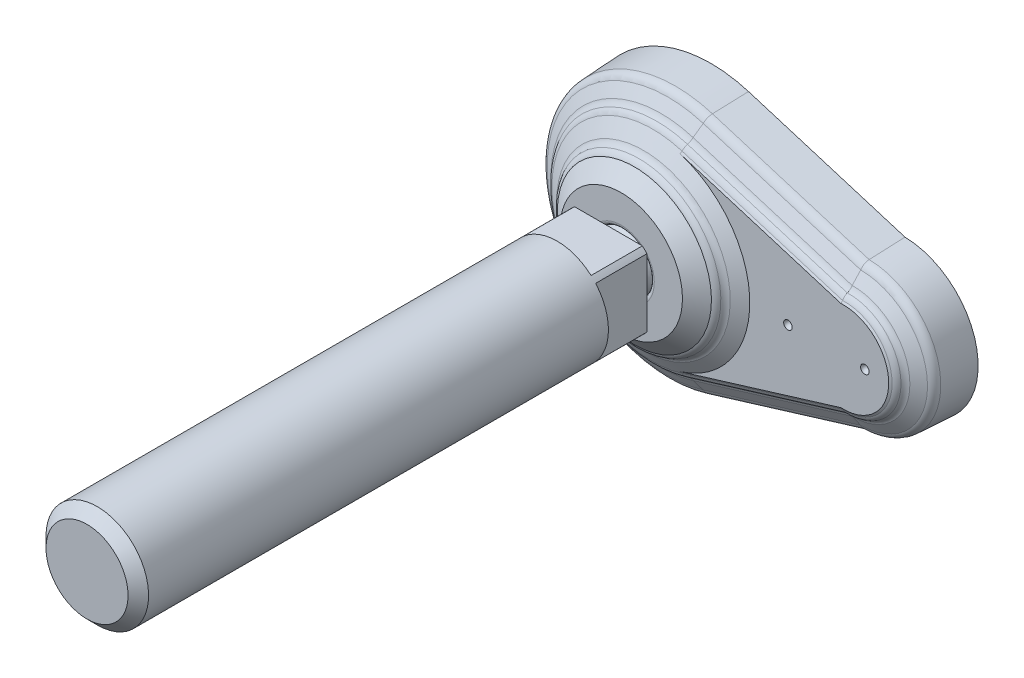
ISO-10303-21;
HEADER;
FILE_DESCRIPTION(('STEP AP214'),'2;1');
FILE_NAME('part.step','',(''),(''),'','','');
FILE_SCHEMA(('AUTOMOTIVE_DESIGN { 1 0 10303 214 1 1 1 1 }'));
ENDSEC;
DATA;
#1=APPLICATION_CONTEXT('core data for automotive mechanical design processes');
#2=APPLICATION_PROTOCOL_DEFINITION('international standard','automotive_design',2000,#1);
#3=PRODUCT_CONTEXT('',#1,'mechanical');
#4=PRODUCT('Part','Part','',(#3));
#5=PRODUCT_RELATED_PRODUCT_CATEGORY('part','',(#4));
#6=PRODUCT_DEFINITION_FORMATION('','',#4);
#7=PRODUCT_DEFINITION_CONTEXT('part definition',#1,'design');
#8=PRODUCT_DEFINITION('design','',#6,#7);
#9=PRODUCT_DEFINITION_SHAPE('','',#8);
#10=(LENGTH_UNIT() NAMED_UNIT(*) SI_UNIT(.MILLI.,.METRE.));
#11=(NAMED_UNIT(*) PLANE_ANGLE_UNIT() SI_UNIT($,.RADIAN.));
#12=(NAMED_UNIT(*) SI_UNIT($,.STERADIAN.) SOLID_ANGLE_UNIT());
#13=UNCERTAINTY_MEASURE_WITH_UNIT(LENGTH_MEASURE(1.E-05),#10,'distance_accuracy_value','');
#14=(GEOMETRIC_REPRESENTATION_CONTEXT(3) GLOBAL_UNCERTAINTY_ASSIGNED_CONTEXT((#13)) GLOBAL_UNIT_ASSIGNED_CONTEXT((#10,
#11,#12)) REPRESENTATION_CONTEXT('',''));
#15=CARTESIAN_POINT('',(0.,0.,0.));
#16=DIRECTION('',(0.,0.,1.));
#17=DIRECTION('',(1.,0.,0.));
#18=AXIS2_PLACEMENT_3D('',#15,#16,#17);
#19=CARTESIAN_POINT('',(0.,0.,36.));
#20=DIRECTION('',(0.,0.,1.));
#21=DIRECTION('',(-1.,0.,0.));
#22=AXIS2_PLACEMENT_3D('',#19,#20,#21);
#23=CYLINDRICAL_SURFACE('',#22,12.);
#24=CARTESIAN_POINT('',(0.,0.,143.6));
#25=DIRECTION('',(0.,0.,1.));
#26=DIRECTION('',(-1.,0.,0.));
#27=AXIS2_PLACEMENT_3D('',#24,#25,#26);
#28=CIRCLE('',#27,12.);
#29=CARTESIAN_POINT('',(-12.,0.,143.6));
#30=VERTEX_POINT('',#29);
#31=EDGE_CURVE('E9',#30,#30,#28,.F.);
#32=ORIENTED_EDGE('',*,*,#31,.T.);
#33=EDGE_LOOP('',(#32));
#34=FACE_BOUND('',#33,.T.);
#35=DIRECTION('',(0.,0.,1.));
#36=VECTOR('',#35,1.);
#37=CARTESIAN_POINT('',(-7.93725393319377,-9.,36.));
#38=LINE('',#37,#36);
#39=CARTESIAN_POINT('',(-7.93725393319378,-9.,36.));
#40=VERTEX_POINT('',#39);
#41=CARTESIAN_POINT('',(-7.93725393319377,-9.,24.));
#42=VERTEX_POINT('',#41);
#43=EDGE_CURVE('E136',#40,#42,#38,.F.);
#44=ORIENTED_EDGE('',*,*,#43,.F.);
#45=CARTESIAN_POINT('',(0.,0.,36.));
#46=DIRECTION('',(0.,0.,1.));
#47=DIRECTION('',(0.,-1.,0.));
#48=AXIS2_PLACEMENT_3D('',#45,#46,#47);
#49=CIRCLE('',#48,12.);
#50=CARTESIAN_POINT('',(7.93725393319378,-9.,36.));
#51=VERTEX_POINT('',#50);
#52=EDGE_CURVE('E598',#40,#51,#49,.T.);
#53=ORIENTED_EDGE('',*,*,#52,.T.);
#54=DIRECTION('',(0.,0.,1.));
#55=VECTOR('',#54,1.);
#56=CARTESIAN_POINT('',(7.93725393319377,-9.,36.));
#57=LINE('',#56,#55);
#58=CARTESIAN_POINT('',(7.93725393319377,-9.,24.));
#59=VERTEX_POINT('',#58);
#60=EDGE_CURVE('E201',#59,#51,#57,.T.);
#61=ORIENTED_EDGE('',*,*,#60,.F.);
#62=CARTESIAN_POINT('',(0.,0.,24.));
#63=DIRECTION('',(0.,0.,1.));
#64=DIRECTION('',(-1.,0.,0.));
#65=AXIS2_PLACEMENT_3D('',#62,#63,#64);
#66=CIRCLE('',#65,12.);
#67=CARTESIAN_POINT('',(9.,-7.93725393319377,24.));
#68=VERTEX_POINT('',#67);
#69=EDGE_CURVE('E184',#59,#68,#66,.T.);
#70=ORIENTED_EDGE('',*,*,#69,.T.);
#71=DIRECTION('',(0.,0.,1.));
#72=VECTOR('',#71,1.);
#73=CARTESIAN_POINT('',(9.,-7.93725393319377,36.));
#74=LINE('',#73,#72);
#75=CARTESIAN_POINT('',(9.,-7.93725393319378,36.));
#76=VERTEX_POINT('',#75);
#77=EDGE_CURVE('E198',#76,#68,#74,.F.);
#78=ORIENTED_EDGE('',*,*,#77,.F.);
#79=CARTESIAN_POINT('',(9.,7.93725393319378,36.));
#80=VERTEX_POINT('',#79);
#81=EDGE_CURVE('E266',#76,#80,#49,.T.);
#82=ORIENTED_EDGE('',*,*,#81,.T.);
#83=DIRECTION('',(0.,0.,1.));
#84=VECTOR('',#83,1.);
#85=CARTESIAN_POINT('',(9.,7.93725393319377,36.));
#86=LINE('',#85,#84);
#87=CARTESIAN_POINT('',(9.,7.93725393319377,24.));
#88=VERTEX_POINT('',#87);
#89=EDGE_CURVE('E243',#88,#80,#86,.T.);
#90=ORIENTED_EDGE('',*,*,#89,.F.);
#91=CARTESIAN_POINT('',(7.93725393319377,9.,24.));
#92=VERTEX_POINT('',#91);
#93=EDGE_CURVE('E180',#88,#92,#66,.T.);
#94=ORIENTED_EDGE('',*,*,#93,.T.);
#95=DIRECTION('',(0.,0.,1.));
#96=VECTOR('',#95,1.);
#97=CARTESIAN_POINT('',(7.93725393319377,9.,36.));
#98=LINE('',#97,#96);
#99=CARTESIAN_POINT('',(7.93725393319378,9.,36.));
#100=VERTEX_POINT('',#99);
#101=EDGE_CURVE('E161',#100,#92,#98,.F.);
#102=ORIENTED_EDGE('',*,*,#101,.F.);
#103=CARTESIAN_POINT('',(-7.93725393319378,9.,36.));
#104=VERTEX_POINT('',#103);
#105=EDGE_CURVE('E174',#100,#104,#49,.T.);
#106=ORIENTED_EDGE('',*,*,#105,.T.);
#107=DIRECTION('',(0.,0.,1.));
#108=VECTOR('',#107,1.);
#109=CARTESIAN_POINT('',(-7.93725393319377,9.,36.));
#110=LINE('',#109,#108);
#111=CARTESIAN_POINT('',(-7.93725393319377,9.,24.));
#112=VERTEX_POINT('',#111);
#113=EDGE_CURVE('E159',#112,#104,#110,.T.);
#114=ORIENTED_EDGE('',*,*,#113,.F.);
#115=CARTESIAN_POINT('',(-9.,7.93725393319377,24.));
#116=VERTEX_POINT('',#115);
#117=EDGE_CURVE('E172',#112,#116,#66,.T.);
#118=ORIENTED_EDGE('',*,*,#117,.T.);
#119=DIRECTION('',(0.,0.,1.));
#120=VECTOR('',#119,1.);
#121=CARTESIAN_POINT('',(-9.,7.93725393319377,36.));
#122=LINE('',#121,#120);
#123=CARTESIAN_POINT('',(-9.,7.93725393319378,36.));
#124=VERTEX_POINT('',#123);
#125=EDGE_CURVE('E175',#124,#116,#122,.F.);
#126=ORIENTED_EDGE('',*,*,#125,.F.);
#127=CARTESIAN_POINT('',(-9.,-7.93725393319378,36.));
#128=VERTEX_POINT('',#127);
#129=EDGE_CURVE('E599',#124,#128,#49,.T.);
#130=ORIENTED_EDGE('',*,*,#129,.T.);
#131=DIRECTION('',(0.,0.,1.));
#132=VECTOR('',#131,1.);
#133=CARTESIAN_POINT('',(-9.,-7.93725393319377,36.));
#134=LINE('',#133,#132);
#135=CARTESIAN_POINT('',(-9.,-7.93725393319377,24.));
#136=VERTEX_POINT('',#135);
#137=EDGE_CURVE('E181',#136,#128,#134,.T.);
#138=ORIENTED_EDGE('',*,*,#137,.F.);
#139=EDGE_CURVE('E183',#136,#42,#66,.T.);
#140=ORIENTED_EDGE('',*,*,#139,.T.);
#141=EDGE_LOOP('',(#44,#53,#61,#70,#78,#82,#90,#94,#102,#106,#114,#118,#126,#130,#138,#140));
#142=FACE_BOUND('',#141,.T.);
#143=ADVANCED_FACE('F14',(#34,#142),#23,.T.);
#144=CARTESIAN_POINT('',(-5.24903501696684,0.,24.));
#145=DIRECTION('',(0.,0.,1.));
#146=DIRECTION('',(-1.,0.,0.));
#147=AXIS2_PLACEMENT_3D('',#144,#145,#146);
#148=PLANE('',#147);
#149=DIRECTION('',(0.,-1.,0.));
#150=VECTOR('',#149,1.);
#151=CARTESIAN_POINT('',(-9.,9.,24.));
#152=LINE('',#151,#150);
#153=EDGE_CURVE('E31',#116,#136,#152,.T.);
#154=ORIENTED_EDGE('',*,*,#153,.F.);
#155=ORIENTED_EDGE('',*,*,#117,.F.);
#156=DIRECTION('',(-1.,0.,0.));
#157=VECTOR('',#156,1.);
#158=CARTESIAN_POINT('',(9.,9.,24.));
#159=LINE('',#158,#157);
#160=EDGE_CURVE('E154',#92,#112,#159,.T.);
#161=ORIENTED_EDGE('',*,*,#160,.F.);
#162=ORIENTED_EDGE('',*,*,#93,.F.);
#163=DIRECTION('',(0.,1.,0.));
#164=VECTOR('',#163,1.);
#165=CARTESIAN_POINT('',(9.,-9.,24.));
#166=LINE('',#165,#164);
#167=EDGE_CURVE('E166',#68,#88,#166,.T.);
#168=ORIENTED_EDGE('',*,*,#167,.F.);
#169=ORIENTED_EDGE('',*,*,#69,.F.);
#170=DIRECTION('',(1.,0.,0.));
#171=VECTOR('',#170,1.);
#172=CARTESIAN_POINT('',(-9.,-9.,24.));
#173=LINE('',#172,#171);
#174=EDGE_CURVE('E203',#42,#59,#173,.T.);
#175=ORIENTED_EDGE('',*,*,#174,.F.);
#176=ORIENTED_EDGE('',*,*,#139,.F.);
#177=EDGE_LOOP('',(#154,#155,#161,#162,#168,#169,#175,#176));
#178=FACE_BOUND('',#177,.T.);
#179=CARTESIAN_POINT('',(0.,0.,24.));
#180=DIRECTION('',(0.,0.,1.));
#181=DIRECTION('',(-1.,0.,0.));
#182=AXIS2_PLACEMENT_3D('',#179,#180,#181);
#183=CIRCLE('',#182,5.24903501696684);
#184=CARTESIAN_POINT('',(-5.24903501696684,0.,24.));
#185=VERTEX_POINT('',#184);
#186=EDGE_CURVE('E189',#185,#185,#183,.T.);
#187=ORIENTED_EDGE('',*,*,#186,.T.);
#188=EDGE_LOOP('',(#187));
#189=FACE_BOUND('',#188,.T.);
#190=ADVANCED_FACE('F177',(#178,#189),#148,.F.);
#191=CARTESIAN_POINT('',(0.,0.,17.6309999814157));
#192=DIRECTION('',(0.,0.,1.));
#193=DIRECTION('',(-1.,0.,0.));
#194=AXIS2_PLACEMENT_3D('',#191,#192,#193);
#195=DEGENERATE_TOROIDAL_SURFACE('',#194,0.0005038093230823,6.829,.T.);
#196=CARTESIAN_POINT('',(0.,0.,18.775));
#197=DIRECTION('',(0.,0.,-1.));
#198=DIRECTION('',(1.,0.,0.));
#199=AXIS2_PLACEMENT_3D('',#196,#197,#198);
#200=CIRCLE('',#199,6.733);
#201=CARTESIAN_POINT('',(6.733,0.,18.775));
#202=VERTEX_POINT('',#201);
#203=EDGE_CURVE('E250',#202,#202,#200,.T.);
#204=ORIENTED_EDGE('',*,*,#203,.F.);
#205=EDGE_LOOP('',(#204));
#206=FACE_BOUND('',#205,.T.);
#207=CARTESIAN_POINT('',(0.,0.,22.));
#208=DIRECTION('',(0.,0.,1.));
#209=DIRECTION('',(-1.,0.,0.));
#210=AXIS2_PLACEMENT_3D('',#207,#208,#209);
#211=CIRCLE('',#210,5.24903501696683);
#212=CARTESIAN_POINT('',(-5.24903501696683,0.,22.));
#213=VERTEX_POINT('',#212);
#214=EDGE_CURVE('E191',#213,#213,#211,.T.);
#215=ORIENTED_EDGE('',*,*,#214,.F.);
#216=EDGE_LOOP('',(#215));
#217=FACE_BOUND('',#216,.T.);
#218=ADVANCED_FACE('F472',(#206,#217),#195,.T.);
#219=CARTESIAN_POINT('',(0.,0.,36.));
#220=DIRECTION('',(0.,0.,1.));
#221=DIRECTION('',(-1.,0.,0.));
#222=AXIS2_PLACEMENT_3D('',#219,#220,#221);
#223=CYLINDRICAL_SURFACE('',#222,5.24903501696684);
#224=ORIENTED_EDGE('',*,*,#186,.F.);
#225=EDGE_LOOP('',(#224));
#226=FACE_BOUND('',#225,.T.);
#227=ORIENTED_EDGE('',*,*,#214,.T.);
#228=EDGE_LOOP('',(#227));
#229=FACE_BOUND('',#228,.T.);
#230=ADVANCED_FACE('F574',(#226,#229),#223,.T.);
#231=CARTESIAN_POINT('',(-9.,-9.,24.));
#232=DIRECTION('',(0.,-1.,0.));
#233=DIRECTION('',(1.,0.,0.));
#234=AXIS2_PLACEMENT_3D('',#231,#232,#233);
#235=PLANE('',#234);
#236=ORIENTED_EDGE('',*,*,#60,.T.);
#237=DIRECTION('',(-1.,0.,0.));
#238=VECTOR('',#237,1.);
#239=CARTESIAN_POINT('',(-12.,-9.,36.));
#240=LINE('',#239,#238);
#241=EDGE_CURVE('E215',#51,#40,#240,.T.);
#242=ORIENTED_EDGE('',*,*,#241,.T.);
#243=ORIENTED_EDGE('',*,*,#43,.T.);
#244=ORIENTED_EDGE('',*,*,#174,.T.);
#245=EDGE_LOOP('',(#236,#242,#243,#244));
#246=FACE_BOUND('',#245,.T.);
#247=ADVANCED_FACE('F572',(#246),#235,.T.);
#248=CARTESIAN_POINT('',(9.,-9.,24.));
#249=DIRECTION('',(1.,0.,0.));
#250=DIRECTION('',(0.,1.,0.));
#251=AXIS2_PLACEMENT_3D('',#248,#249,#250);
#252=PLANE('',#251);
#253=ORIENTED_EDGE('',*,*,#89,.T.);
#254=DIRECTION('',(0.,-1.,0.));
#255=VECTOR('',#254,1.);
#256=CARTESIAN_POINT('',(9.,0.,36.));
#257=LINE('',#256,#255);
#258=EDGE_CURVE('E222',#80,#76,#257,.T.);
#259=ORIENTED_EDGE('',*,*,#258,.T.);
#260=ORIENTED_EDGE('',*,*,#77,.T.);
#261=ORIENTED_EDGE('',*,*,#167,.T.);
#262=EDGE_LOOP('',(#253,#259,#260,#261));
#263=FACE_BOUND('',#262,.T.);
#264=ADVANCED_FACE('F568',(#263),#252,.T.);
#265=CARTESIAN_POINT('',(9.,9.,24.));
#266=DIRECTION('',(0.,1.,0.));
#267=DIRECTION('',(-1.,0.,0.));
#268=AXIS2_PLACEMENT_3D('',#265,#266,#267);
#269=PLANE('',#268);
#270=ORIENTED_EDGE('',*,*,#113,.T.);
#271=DIRECTION('',(1.,0.,0.));
#272=VECTOR('',#271,1.);
#273=CARTESIAN_POINT('',(-12.,9.,36.));
#274=LINE('',#273,#272);
#275=EDGE_CURVE('E226',#104,#100,#274,.T.);
#276=ORIENTED_EDGE('',*,*,#275,.T.);
#277=ORIENTED_EDGE('',*,*,#101,.T.);
#278=ORIENTED_EDGE('',*,*,#160,.T.);
#279=EDGE_LOOP('',(#270,#276,#277,#278));
#280=FACE_BOUND('',#279,.T.);
#281=ADVANCED_FACE('F156',(#280),#269,.T.);
#282=CARTESIAN_POINT('',(-9.,9.,24.));
#283=DIRECTION('',(-1.,0.,0.));
#284=DIRECTION('',(0.,-1.,0.));
#285=AXIS2_PLACEMENT_3D('',#282,#283,#284);
#286=PLANE('',#285);
#287=ORIENTED_EDGE('',*,*,#137,.T.);
#288=DIRECTION('',(0.,1.,0.));
#289=VECTOR('',#288,1.);
#290=CARTESIAN_POINT('',(-9.,0.,36.));
#291=LINE('',#290,#289);
#292=EDGE_CURVE('E239',#128,#124,#291,.T.);
#293=ORIENTED_EDGE('',*,*,#292,.T.);
#294=ORIENTED_EDGE('',*,*,#125,.T.);
#295=ORIENTED_EDGE('',*,*,#153,.T.);
#296=EDGE_LOOP('',(#287,#293,#294,#295));
#297=FACE_BOUND('',#296,.T.);
#298=ADVANCED_FACE('F482',(#297),#286,.T.);
#299=CARTESIAN_POINT('',(45.,0.,0.));
#300=DIRECTION('',(0.,0.,-1.));
#301=DIRECTION('',(0.,1.,0.));
#302=AXIS2_PLACEMENT_3D('',#299,#300,#301);
#303=CONICAL_SURFACE('',#302,17.5,0.0523365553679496);
#304=CARTESIAN_POINT('',(45.,0.,8.304));
#305=DIRECTION('',(0.,0.,1.));
#306=DIRECTION('',(0.,-1.,0.));
#307=AXIS2_PLACEMENT_3D('',#304,#305,#306);
#308=CIRCLE('',#307,17.065);
#309=CARTESIAN_POINT('',(45.3136024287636,-17.0621182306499,8.304));
#310=VERTEX_POINT('',#309);
#311=CARTESIAN_POINT('',(45.3136024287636,17.0621182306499,8.304));
#312=VERTEX_POINT('',#311);
#313=EDGE_CURVE('E304',#310,#312,#308,.T.);
#314=ORIENTED_EDGE('',*,*,#313,.F.);
#315=CARTESIAN_POINT('',(45.3136007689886,-17.0621077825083,8.3042));
#316=CARTESIAN_POINT('',(45.3250873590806,-17.134412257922,6.92013380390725));
#317=CARTESIAN_POINT('',(45.3366049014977,-17.206707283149,5.5360673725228));
#318=CARTESIAN_POINT('',(45.3597018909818,-17.3512784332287,2.76793403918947));
#319=CARTESIAN_POINT('',(45.3712813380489,-17.4235545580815,1.38386713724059));
#320=CARTESIAN_POINT('',(45.3828917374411,-17.4958212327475,-0.000200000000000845));
#321=B_SPLINE_CURVE_WITH_KNOTS('',3,(#315,#316,#317,#318,#319,#320),.UNSPECIFIED.,.F.,.F.,(4,2,
4),(0.,4.15800336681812,8.31600673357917),.UNSPECIFIED.);
#322=CARTESIAN_POINT('',(45.3828900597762,-17.4958107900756,0.));
#323=VERTEX_POINT('',#322);
#324=EDGE_CURVE('E949',#310,#323,#321,.T.);
#325=ORIENTED_EDGE('',*,*,#324,.T.);
#326=CARTESIAN_POINT('',(45.,0.,0.));
#327=DIRECTION('',(0.,0.,1.));
#328=DIRECTION('',(0.,-1.,0.));
#329=AXIS2_PLACEMENT_3D('',#326,#327,#328);
#330=CIRCLE('',#329,17.5);
#331=CARTESIAN_POINT('',(45.3828900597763,17.4958107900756,0.));
#332=VERTEX_POINT('',#331);
#333=EDGE_CURVE('E307',#323,#332,#330,.T.);
#334=ORIENTED_EDGE('',*,*,#333,.T.);
#335=CARTESIAN_POINT('',(45.3828917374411,17.4958212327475,-0.000200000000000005));
#336=CARTESIAN_POINT('',(45.371281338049,17.4235545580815,1.38386713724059));
#337=CARTESIAN_POINT('',(45.359701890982,17.3512784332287,2.76793403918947));
#338=CARTESIAN_POINT('',(45.3366049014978,17.206707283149,5.5360673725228));
#339=CARTESIAN_POINT('',(45.3250873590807,17.134412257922,6.92013380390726));
#340=CARTESIAN_POINT('',(45.3136007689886,17.0621077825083,8.3042));
#341=B_SPLINE_CURVE_WITH_KNOTS('',3,(#335,#336,#337,#338,#339,#340),.UNSPECIFIED.,.F.,.F.,(4,2,
4),(0.,4.15800336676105,8.31600673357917),.UNSPECIFIED.);
#342=EDGE_CURVE('E942',#332,#312,#341,.T.);
#343=ORIENTED_EDGE('',*,*,#342,.T.);
#344=EDGE_LOOP('',(#314,#325,#334,#343));
#345=FACE_BOUND('',#344,.T.);
#346=ADVANCED_FACE('F362',(#345),#303,.T.);
#347=CARTESIAN_POINT('',(46.8961596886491,-16.5782819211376,8.304));
#348=DIRECTION('',(-0.291971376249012,0.9549953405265,-0.0523126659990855));
#349=DIRECTION('',(-0.956304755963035,-0.292371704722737,0.));
#350=AXIS2_PLACEMENT_3D('',#347,#348,#349);
#351=PLANE('',#350);
#352=ORIENTED_EDGE('',*,*,#324,.F.);
#353=DIRECTION('',(-0.956304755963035,-0.292371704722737,0.));
#354=VECTOR('',#353,1.);
#355=CARTESIAN_POINT('',(46.8961596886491,-16.5782819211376,8.304));
#356=LINE('',#355,#354);
#357=CARTESIAN_POINT('',(8.64396945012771,-28.2731501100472,8.304));
#358=VERTEX_POINT('',#357);
#359=EDGE_CURVE('E974',#310,#358,#356,.T.);
#360=ORIENTED_EDGE('',*,*,#359,.T.);
#361=DIRECTION('',(-0.0152947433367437,0.050026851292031,0.998630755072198));
#362=VECTOR('',#361,1.);
#363=CARTESIAN_POINT('',(8.7711511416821,-28.689142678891,0.));
#364=LINE('',#363,#362);
#365=CARTESIAN_POINT('',(8.7711511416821,-28.689142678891,0.));
#366=VERTEX_POINT('',#365);
#367=EDGE_CURVE('E987',#366,#358,#364,.T.);
#368=ORIENTED_EDGE('',*,*,#367,.F.);
#369=DIRECTION('',(-0.956304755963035,-0.292371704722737,0.));
#370=VECTOR('',#369,1.);
#371=CARTESIAN_POINT('',(47.0233413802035,-16.9942744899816,0.));
#372=LINE('',#371,#370);
#373=EDGE_CURVE('E127',#323,#366,#372,.T.);
#374=ORIENTED_EDGE('',*,*,#373,.F.);
#375=EDGE_LOOP('',(#352,#360,#368,#374));
#376=FACE_BOUND('',#375,.T.);
#377=ADVANCED_FACE('F468',(#376),#351,.F.);
#378=CARTESIAN_POINT('',(0.,0.,0.));
#379=DIRECTION('',(0.,0.,1.));
#380=DIRECTION('',(0.,-1.,0.));
#381=AXIS2_PLACEMENT_3D('',#378,#379,#380);
#382=PLANE('',#381);
#383=DIRECTION('',(-0.956304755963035,0.292371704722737,0.));
#384=VECTOR('',#383,1.);
#385=CARTESIAN_POINT('',(47.0233413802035,16.9942744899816,0.));
#386=LINE('',#385,#384);
#387=CARTESIAN_POINT('',(8.7711511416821,28.689142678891,0.));
#388=VERTEX_POINT('',#387);
#389=EDGE_CURVE('E972',#332,#388,#386,.T.);
#390=ORIENTED_EDGE('',*,*,#389,.F.);
#391=ORIENTED_EDGE('',*,*,#333,.F.);
#392=ORIENTED_EDGE('',*,*,#373,.T.);
#393=CARTESIAN_POINT('',(0.,0.,0.));
#394=DIRECTION('',(0.,0.,1.));
#395=DIRECTION('',(0.,-1.,0.));
#396=AXIS2_PLACEMENT_3D('',#393,#394,#395);
#397=CIRCLE('',#396,30.);
#398=EDGE_CURVE('E351',#388,#366,#397,.T.);
#399=ORIENTED_EDGE('',*,*,#398,.F.);
#400=EDGE_LOOP('',(#390,#391,#392,#399));
#401=FACE_BOUND('',#400,.T.);
#402=CARTESIAN_POINT('',(32.,0.,0.));
#403=DIRECTION('',(0.,0.,-1.));
#404=DIRECTION('',(0.,1.,0.));
#405=AXIS2_PLACEMENT_3D('',#402,#403,#404);
#406=CIRCLE('',#405,4.25);
#407=CARTESIAN_POINT('',(32.,4.25,0.));
#408=VERTEX_POINT('',#407);
#409=EDGE_CURVE('E600',#408,#408,#406,.T.);
#410=ORIENTED_EDGE('',*,*,#409,.F.);
#411=EDGE_LOOP('',(#410));
#412=FACE_BOUND('',#411,.T.);
#413=CARTESIAN_POINT('',(50.,0.,0.));
#414=DIRECTION('',(0.,0.,-1.));
#415=DIRECTION('',(0.,1.,0.));
#416=AXIS2_PLACEMENT_3D('',#413,#414,#415);
#417=CIRCLE('',#416,4.25);
#418=CARTESIAN_POINT('',(50.,4.25,0.));
#419=VERTEX_POINT('',#418);
#420=EDGE_CURVE('E603',#419,#419,#417,.T.);
#421=ORIENTED_EDGE('',*,*,#420,.F.);
#422=EDGE_LOOP('',(#421));
#423=FACE_BOUND('',#422,.T.);
#424=ADVANCED_FACE('F360',(#401,#412,#423),#382,.F.);
#425=CARTESIAN_POINT('',(47.0233413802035,16.9942744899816,0.));
#426=DIRECTION('',(-0.291971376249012,-0.9549953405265,-0.0523126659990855));
#427=DIRECTION('',(0.956304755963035,-0.292371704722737,0.));
#428=AXIS2_PLACEMENT_3D('',#425,#426,#427);
#429=PLANE('',#428);
#430=ORIENTED_EDGE('',*,*,#342,.F.);
#431=ORIENTED_EDGE('',*,*,#389,.T.);
#432=DIRECTION('',(-0.0152947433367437,-0.050026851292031,0.998630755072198));
#433=VECTOR('',#432,1.);
#434=CARTESIAN_POINT('',(8.7711511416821,28.689142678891,0.));
#435=LINE('',#434,#433);
#436=CARTESIAN_POINT('',(8.64396945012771,28.2731501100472,8.304));
#437=VERTEX_POINT('',#436);
#438=EDGE_CURVE('E1004',#388,#437,#435,.T.);
#439=ORIENTED_EDGE('',*,*,#438,.T.);
#440=DIRECTION('',(-0.956304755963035,0.292371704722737,0.));
#441=VECTOR('',#440,1.);
#442=CARTESIAN_POINT('',(46.8961596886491,16.5782819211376,8.304));
#443=LINE('',#442,#441);
#444=EDGE_CURVE('E970',#312,#437,#443,.T.);
#445=ORIENTED_EDGE('',*,*,#444,.F.);
#446=EDGE_LOOP('',(#430,#431,#439,#445));
#447=FACE_BOUND('',#446,.T.);
#448=ADVANCED_FACE('F438',(#447),#429,.F.);
#449=CARTESIAN_POINT('',(45.,0.,8.20868962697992));
#450=DIRECTION('',(0.,0.,1.));
#451=DIRECTION('',(0.,-1.,0.));
#452=AXIS2_PLACEMENT_3D('',#449,#450,#451);
#453=TOROIDAL_SURFACE('',#452,15.0672723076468,2.);
#454=CARTESIAN_POINT('',(45.313603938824,-17.062127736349,8.3038));
#455=CARTESIAN_POINT('',(45.3131828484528,-17.0594763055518,8.3596419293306));
#456=CARTESIAN_POINT('',(45.3123906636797,-17.0544900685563,8.41534315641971));
#457=CARTESIAN_POINT('',(45.3100724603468,-17.0398916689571,8.52611669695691));
#458=CARTESIAN_POINT('',(45.3085464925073,-17.0302798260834,8.5811890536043));
#459=CARTESIAN_POINT('',(45.3028875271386,-16.9946160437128,8.7447437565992));
#460=CARTESIAN_POINT('',(45.2976717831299,-16.9617253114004,8.85178061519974));
#461=CARTESIAN_POINT('',(45.284530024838,-16.8786837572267,9.05872519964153));
#462=CARTESIAN_POINT('',(45.2766032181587,-16.8285278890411,9.1586308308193));
#463=CARTESIAN_POINT('',(45.2583029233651,-16.7124179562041,9.34857034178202));
#464=CARTESIAN_POINT('',(45.24792931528,-16.6464631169,9.43860373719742));
#465=CARTESIAN_POINT('',(45.2250216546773,-16.5003240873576,9.60671335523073));
#466=CARTESIAN_POINT('',(45.2124772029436,-16.4200713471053,9.68472843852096));
#467=CARTESIAN_POINT('',(45.1856662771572,-16.2478592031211,9.8261370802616));
#468=CARTESIAN_POINT('',(45.1714009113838,-16.1559073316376,9.88953997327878));
#469=CARTESIAN_POINT('',(45.148748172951,-16.0092275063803,9.97356807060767));
#470=CARTESIAN_POINT('',(45.1408156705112,-15.957749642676,10.0001426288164));
#471=CARTESIAN_POINT('',(45.1246863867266,-15.8528232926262,10.0486569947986));
#472=CARTESIAN_POINT('',(45.1164901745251,-15.7993790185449,10.0706061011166));
#473=CARTESIAN_POINT('',(45.1081834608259,-15.7450737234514,10.0902));
#474=B_SPLINE_CURVE_WITH_KNOTS('',3,(#454,#455,#456,#457,#458,#459,#460,#461,#462,#463,#464,
#465,#466,#467,#468,#469,#470,#471,#472,#473),.UNSPECIFIED.,.F.,.F.,(4,2,2,2,2,2,2,2,2,4),(0.,
0.167615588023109,0.335219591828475,0.669784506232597,1.00444729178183,1.33912648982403,
1.67545571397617,2.01156948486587,2.1867983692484,2.36167155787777),.UNSPECIFIED.);
#475=CARTESIAN_POINT('',(45.108268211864,-15.7456277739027,10.09));
#476=VERTEX_POINT('',#475);
#477=EDGE_CURVE('E950',#310,#476,#474,.T.);
#478=ORIENTED_EDGE('',*,*,#477,.F.);
#479=ORIENTED_EDGE('',*,*,#313,.T.);
#480=CARTESIAN_POINT('',(45.1081834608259,15.7450737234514,10.0902));
#481=CARTESIAN_POINT('',(45.1162755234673,15.7979756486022,10.0711117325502));
#482=CARTESIAN_POINT('',(45.1242625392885,15.8500594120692,10.0497900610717));
#483=CARTESIAN_POINT('',(45.1399729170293,15.9522733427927,10.0028085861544));
#484=CARTESIAN_POINT('',(45.1476962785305,16.0024035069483,9.97714877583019));
#485=CARTESIAN_POINT('',(45.170371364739,16.1492634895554,9.89392549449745));
#486=CARTESIAN_POINT('',(45.1848488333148,16.2425982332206,9.83006921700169));
#487=CARTESIAN_POINT('',(45.2120467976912,16.4173167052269,9.6873614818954));
#488=CARTESIAN_POINT('',(45.2247661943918,16.4986929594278,9.60850071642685));
#489=CARTESIAN_POINT('',(45.2480269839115,16.647087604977,9.4379734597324));
#490=CARTESIAN_POINT('',(45.2585686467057,16.7141077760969,9.34630855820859));
#491=CARTESIAN_POINT('',(45.2770522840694,16.8313730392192,9.15345563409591));
#492=CARTESIAN_POINT('',(45.2850114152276,16.8817288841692,9.05233645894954));
#493=CARTESIAN_POINT('',(45.298151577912,16.9647535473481,8.84294631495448));
#494=CARTESIAN_POINT('',(45.3033350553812,16.9974379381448,8.73468173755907));
#495=CARTESIAN_POINT('',(45.3088197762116,17.0320013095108,8.57167924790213));
#496=CARTESIAN_POINT('',(45.3102579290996,17.0410597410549,8.51840996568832));
#497=CARTESIAN_POINT('',(45.3124461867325,17.0548396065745,8.41140374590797));
#498=CARTESIAN_POINT('',(45.3131976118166,17.0595693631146,8.35766790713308));
#499=CARTESIAN_POINT('',(45.313603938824,17.062127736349,8.3038));
#500=B_SPLINE_CURVE_WITH_KNOTS('',3,(#480,#481,#482,#483,#484,#485,#486,#487,#488,#489,#490,
#491,#492,#493,#494,#495,#496,#497,#498,#499),.UNSPECIFIED.,.F.,.F.,(4,2,2,2,2,2,2,2,2,4),(0.,
0.170355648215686,0.340711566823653,0.680992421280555,1.02148505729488,1.36193545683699,
1.70007548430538,2.03791704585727,2.19992239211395,2.36161559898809),.UNSPECIFIED.);
#501=CARTESIAN_POINT('',(45.1082682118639,15.7456277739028,10.09));
#502=VERTEX_POINT('',#501);
#503=EDGE_CURVE('E427',#502,#312,#500,.T.);
#504=ORIENTED_EDGE('',*,*,#503,.F.);
#505=CARTESIAN_POINT('',(45.,0.,10.09));
#506=DIRECTION('',(0.,0.,1.));
#507=DIRECTION('',(0.,-1.,0.));
#508=AXIS2_PLACEMENT_3D('',#505,#506,#507);
#509=CIRCLE('',#508,15.746);
#510=EDGE_CURVE('E301',#476,#502,#509,.T.);
#511=ORIENTED_EDGE('',*,*,#510,.F.);
#512=EDGE_LOOP('',(#478,#479,#504,#511));
#513=FACE_BOUND('',#512,.T.);
#514=ADVANCED_FACE('F411',(#513),#453,.T.);
#515=CARTESIAN_POINT('',(46.312080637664,-14.6678454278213,8.20868962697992));
#516=DIRECTION('',(-0.956304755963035,-0.292371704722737,0.));
#517=DIRECTION('',(0.292371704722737,-0.956304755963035,0.));
#518=AXIS2_PLACEMENT_3D('',#515,#516,#517);
#519=CYLINDRICAL_SURFACE('',#518,2.);
#520=ORIENTED_EDGE('',*,*,#359,.F.);
#521=ORIENTED_EDGE('',*,*,#477,.T.);
#522=DIRECTION('',(-0.956304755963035,-0.292371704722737,0.));
#523=VECTOR('',#522,1.);
#524=CARTESIAN_POINT('',(46.5105214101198,-15.3169159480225,10.09));
#525=LINE('',#524,#523);
#526=CARTESIAN_POINT('',(8.25833117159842,-27.0117841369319,10.09));
#527=VERTEX_POINT('',#526);
#528=EDGE_CURVE('E976',#476,#527,#525,.T.);
#529=ORIENTED_EDGE('',*,*,#528,.T.);
#530=CARTESIAN_POINT('',(8.05989039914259,-26.3627136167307,8.20868962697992));
#531=DIRECTION('',(0.956304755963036,0.292371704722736,0.));
#532=DIRECTION('',(-0.292371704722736,0.956304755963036,0.));
#533=AXIS2_PLACEMENT_3D('',#530,#531,#532);
#534=CIRCLE('',#533,2.);
#535=EDGE_CURVE('E990',#527,#358,#534,.T.);
#536=ORIENTED_EDGE('',*,*,#535,.T.);
#537=EDGE_LOOP('',(#520,#521,#529,#536));
#538=FACE_BOUND('',#537,.T.);
#539=ADVANCED_FACE('F439',(#538),#519,.T.);
#540=CARTESIAN_POINT('',(0.,0.,0.));
#541=DIRECTION('',(0.,0.,-1.));
#542=DIRECTION('',(0.,1.,0.));
#543=AXIS2_PLACEMENT_3D('',#540,#541,#542);
#544=CONICAL_SURFACE('',#543,30.,0.0523365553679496);
#545=CARTESIAN_POINT('',(0.,0.,8.304));
#546=DIRECTION('',(0.,0.,1.));
#547=DIRECTION('',(0.,-1.,0.));
#548=AXIS2_PLACEMENT_3D('',#545,#546,#547);
#549=CIRCLE('',#548,29.565);
#550=EDGE_CURVE('E1033',#437,#358,#549,.T.);
#551=ORIENTED_EDGE('',*,*,#550,.F.);
#552=ORIENTED_EDGE('',*,*,#438,.F.);
#553=ORIENTED_EDGE('',*,*,#398,.T.);
#554=ORIENTED_EDGE('',*,*,#367,.T.);
#555=EDGE_LOOP('',(#551,#552,#553,#554));
#556=FACE_BOUND('',#555,.T.);
#557=ADVANCED_FACE('F459',(#556),#544,.T.);
#558=CARTESIAN_POINT('',(46.312080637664,14.6678454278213,8.20868962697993));
#559=DIRECTION('',(-0.956304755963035,0.292371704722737,0.));
#560=DIRECTION('',(-0.292371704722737,-0.956304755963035,0.));
#561=AXIS2_PLACEMENT_3D('',#558,#559,#560);
#562=CYLINDRICAL_SURFACE('',#561,2.);
#563=DIRECTION('',(-0.956304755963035,0.292371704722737,0.));
#564=VECTOR('',#563,1.);
#565=CARTESIAN_POINT('',(46.5105214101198,15.3169159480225,10.09));
#566=LINE('',#565,#564);
#567=CARTESIAN_POINT('',(8.25833117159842,27.0117841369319,10.09));
#568=VERTEX_POINT('',#567);
#569=EDGE_CURVE('E968',#502,#568,#566,.T.);
#570=ORIENTED_EDGE('',*,*,#569,.F.);
#571=ORIENTED_EDGE('',*,*,#503,.T.);
#572=ORIENTED_EDGE('',*,*,#444,.T.);
#573=CARTESIAN_POINT('',(8.05989039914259,26.3627136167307,8.20868962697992));
#574=DIRECTION('',(-0.956304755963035,0.292371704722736,0.));
#575=DIRECTION('',(-0.292371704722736,-0.956304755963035,0.));
#576=AXIS2_PLACEMENT_3D('',#573,#574,#575);
#577=CIRCLE('',#576,2.);
#578=EDGE_CURVE('E1007',#568,#437,#577,.T.);
#579=ORIENTED_EDGE('',*,*,#578,.F.);
#580=EDGE_LOOP('',(#570,#571,#572,#579));
#581=FACE_BOUND('',#580,.T.);
#582=ADVANCED_FACE('F370',(#581),#562,.T.);
#583=CARTESIAN_POINT('',(45.,0.,10.09));
#584=DIRECTION('',(0.,0.,-1.));
#585=DIRECTION('',(0.,1.,0.));
#586=AXIS2_PLACEMENT_3D('',#583,#584,#585);
#587=CONICAL_SURFACE('',#586,15.746,0.993858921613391);
#588=CARTESIAN_POINT('',(45.,0.,11.7170000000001));
#589=DIRECTION('',(0.,0.,1.));
#590=DIRECTION('',(0.,-1.,0.));
#591=AXIS2_PLACEMENT_3D('',#588,#589,#590);
#592=CIRCLE('',#591,13.2459999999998);
#593=CARTESIAN_POINT('',(44.7416637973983,-13.243480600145,11.7170000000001));
#594=VERTEX_POINT('',#593);
#595=CARTESIAN_POINT('',(44.7416637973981,13.2434806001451,11.7170000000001));
#596=VERTEX_POINT('',#595);
#597=EDGE_CURVE('E299',#594,#596,#592,.T.);
#598=ORIENTED_EDGE('',*,*,#597,.F.);
#599=CARTESIAN_POINT('',(44.7416208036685,-13.2431723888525,11.7172000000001));
#600=CARTESIAN_POINT('',(44.8000092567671,-13.66082442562,11.4461588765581));
#601=CARTESIAN_POINT('',(44.8597613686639,-14.078214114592,11.1750215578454));
#602=CARTESIAN_POINT('',(44.9819928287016,-14.9124682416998,10.6325548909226));
#603=CARTESIAN_POINT('',(45.0444721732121,-15.3293326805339,10.3612255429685));
#604=CARTESIAN_POINT('',(45.1083151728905,-15.745934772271,10.0898));
#605=B_SPLINE_CURVE_WITH_KNOTS('',3,(#599,#600,#601,#602,#603,#604),.UNSPECIFIED.,.F.,.F.,(4,2,
4),(0.,1.50389468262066,3.0077873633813),.UNSPECIFIED.);
#606=EDGE_CURVE('E420',#594,#476,#605,.T.);
#607=ORIENTED_EDGE('',*,*,#606,.T.);
#608=ORIENTED_EDGE('',*,*,#510,.T.);
#609=CARTESIAN_POINT('',(45.1083151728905,15.745934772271,10.0898));
#610=CARTESIAN_POINT('',(45.0444721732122,15.3293326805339,10.3612255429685));
#611=CARTESIAN_POINT('',(44.9819928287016,14.9124682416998,10.6325548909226));
#612=CARTESIAN_POINT('',(44.8597613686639,14.078214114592,11.1750215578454));
#613=CARTESIAN_POINT('',(44.8000092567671,13.66082442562,11.4461588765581));
#614=CARTESIAN_POINT('',(44.7416208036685,13.2431723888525,11.7172000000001));
#615=B_SPLINE_CURVE_WITH_KNOTS('',3,(#609,#610,#611,#612,#613,#614),.UNSPECIFIED.,.F.,.F.,(4,2,
4),(0.,1.50389268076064,3.0077873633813),.UNSPECIFIED.);
#616=EDGE_CURVE('E414',#502,#596,#615,.T.);
#617=ORIENTED_EDGE('',*,*,#616,.T.);
#618=EDGE_LOOP('',(#598,#607,#608,#617));
#619=FACE_BOUND('',#618,.T.);
#620=ADVANCED_FACE('F405',(#619),#587,.T.);
#621=CARTESIAN_POINT('',(45.7795921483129,-12.9261540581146,11.7170000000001));
#622=DIRECTION('',(-0.159476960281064,0.521625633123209,-0.838137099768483));
#623=DIRECTION('',(0.,0.849002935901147,0.528388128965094));
#624=AXIS2_PLACEMENT_3D('',#621,#622,#623);
#625=PLANE('',#624);
#626=ORIENTED_EDGE('',*,*,#606,.F.);
#627=DIRECTION('',(-0.956304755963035,-0.292371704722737,0.));
#628=VECTOR('',#627,1.);
#629=CARTESIAN_POINT('',(45.7795921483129,-12.9261540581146,11.7170000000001));
#630=LINE('',#629,#628);
#631=CARTESIAN_POINT('',(7.52740190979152,-24.6210222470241,11.7170000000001));
#632=VERTEX_POINT('',#631);
#633=EDGE_CURVE('E978',#594,#632,#630,.T.);
#634=ORIENTED_EDGE('',*,*,#633,.T.);
#635=DIRECTION('',(-0.245047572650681,0.801514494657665,0.545459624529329));
#636=VECTOR('',#635,1.);
#637=CARTESIAN_POINT('',(8.25833117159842,-27.0117841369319,10.09));
#638=LINE('',#637,#636);
#639=EDGE_CURVE('E993',#527,#632,#638,.T.);
#640=ORIENTED_EDGE('',*,*,#639,.F.);
#641=ORIENTED_EDGE('',*,*,#528,.F.);
#642=EDGE_LOOP('',(#626,#634,#640,#641));
#643=FACE_BOUND('',#642,.T.);
#644=ADVANCED_FACE('F409',(#643),#625,.F.);
#645=CARTESIAN_POINT('',(0.,0.,8.20868962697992));
#646=DIRECTION('',(0.,0.,1.));
#647=DIRECTION('',(0.,-1.,0.));
#648=AXIS2_PLACEMENT_3D('',#645,#646,#647);
#649=TOROIDAL_SURFACE('',#648,27.5672723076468,2.);
#650=CARTESIAN_POINT('',(0.,0.,10.09));
#651=DIRECTION('',(0.,0.,1.));
#652=DIRECTION('',(0.,-1.,0.));
#653=AXIS2_PLACEMENT_3D('',#650,#651,#652);
#654=CIRCLE('',#653,28.246);
#655=EDGE_CURVE('E1031',#568,#527,#654,.T.);
#656=ORIENTED_EDGE('',*,*,#655,.F.);
#657=ORIENTED_EDGE('',*,*,#578,.T.);
#658=ORIENTED_EDGE('',*,*,#550,.T.);
#659=ORIENTED_EDGE('',*,*,#535,.F.);
#660=EDGE_LOOP('',(#656,#657,#658,#659));
#661=FACE_BOUND('',#660,.T.);
#662=ADVANCED_FACE('F436',(#661),#649,.T.);
#663=CARTESIAN_POINT('',(46.5105214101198,15.3169159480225,10.09));
#664=DIRECTION('',(-0.159476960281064,-0.521625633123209,-0.838137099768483));
#665=DIRECTION('',(0.,0.849002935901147,-0.528388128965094));
#666=AXIS2_PLACEMENT_3D('',#663,#664,#665);
#667=PLANE('',#666);
#668=ORIENTED_EDGE('',*,*,#616,.F.);
#669=ORIENTED_EDGE('',*,*,#569,.T.);
#670=DIRECTION('',(-0.245047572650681,-0.801514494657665,0.545459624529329));
#671=VECTOR('',#670,1.);
#672=CARTESIAN_POINT('',(8.25833117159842,27.0117841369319,10.09));
#673=LINE('',#672,#671);
#674=CARTESIAN_POINT('',(7.52740190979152,24.6210222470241,11.7170000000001));
#675=VERTEX_POINT('',#674);
#676=EDGE_CURVE('E1010',#568,#675,#673,.T.);
#677=ORIENTED_EDGE('',*,*,#676,.T.);
#678=DIRECTION('',(-0.956304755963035,0.292371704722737,0.));
#679=VECTOR('',#678,1.);
#680=CARTESIAN_POINT('',(45.7795921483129,12.9261540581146,11.7170000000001));
#681=LINE('',#680,#679);
#682=EDGE_CURVE('E966',#596,#675,#681,.T.);
#683=ORIENTED_EDGE('',*,*,#682,.F.);
#684=EDGE_LOOP('',(#668,#669,#677,#683));
#685=FACE_BOUND('',#684,.T.);
#686=ADVANCED_FACE('F376',(#685),#667,.F.);
#687=CARTESIAN_POINT('',(45.,0.,13.5975547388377));
#688=DIRECTION('',(0.,0.,1.));
#689=DIRECTION('',(0.,-1.,0.));
#690=AXIS2_PLACEMENT_3D('',#687,#688,#689);
#691=TOROIDAL_SURFACE('',#690,13.9471154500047,2.007);
#692=CARTESIAN_POINT('',(44.7417388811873,-13.2440188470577,11.7168000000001));
#693=CARTESIAN_POINT('',(44.7343279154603,-13.1908941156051,11.7365326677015));
#694=CARTESIAN_POINT('',(44.7270601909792,-13.1386083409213,11.7584983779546));
#695=CARTESIAN_POINT('',(44.7128498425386,-13.0360296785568,11.8067671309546));
#696=CARTESIAN_POINT('',(44.7059072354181,-12.9857368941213,11.8330703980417));
#697=CARTESIAN_POINT('',(44.6856140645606,-12.8382408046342,11.9183407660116));
#698=CARTESIAN_POINT('',(44.6728115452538,-12.7445159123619,11.9836326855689));
#699=CARTESIAN_POINT('',(44.6490134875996,-12.5692567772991,12.129233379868));
#700=CARTESIAN_POINT('',(44.6380196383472,-12.487733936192,12.2095560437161));
#701=CARTESIAN_POINT('',(44.6181322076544,-12.3395119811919,12.3828602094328));
#702=CARTESIAN_POINT('',(44.6092328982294,-12.2727724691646,12.4758060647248));
#703=CARTESIAN_POINT('',(44.5998238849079,-12.2019312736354,12.5946409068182));
#704=CARTESIAN_POINT('',(44.5982145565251,-12.1898023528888,12.6158623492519));
#705=CARTESIAN_POINT('',(44.5951037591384,-12.166336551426,12.6587196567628));
#706=CARTESIAN_POINT('',(44.5936021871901,-12.1549989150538,12.6803551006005));
#707=CARTESIAN_POINT('',(44.5921537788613,-12.1440536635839,12.7021999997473));
#708=B_SPLINE_CURVE_WITH_KNOTS('',3,(#692,#693,#694,#695,#696,#697,#698,#699,#700,#701,#702,
#703,#704,#705,#706,#707),.UNSPECIFIED.,.F.,.F.,(4,2,2,2,2,2,2,4),(0.,0.1713558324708,
0.34272053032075,0.685756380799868,1.02911079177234,1.37151502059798,1.44499468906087,
1.51840319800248),.UNSPECIFIED.);
#709=CARTESIAN_POINT('',(44.5921670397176,-12.1441538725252,12.7019999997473));
#710=VERTEX_POINT('',#709);
#711=EDGE_CURVE('E387',#594,#710,#708,.T.);
#712=ORIENTED_EDGE('',*,*,#711,.F.);
#713=ORIENTED_EDGE('',*,*,#597,.T.);
#714=CARTESIAN_POINT('',(44.5921537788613,12.1440536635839,12.7021999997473));
#715=CARTESIAN_POINT('',(44.5955092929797,12.1694097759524,12.6515877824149));
#716=CARTESIAN_POINT('',(44.5991523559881,12.1968896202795,12.602091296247));
#717=CARTESIAN_POINT('',(44.6069951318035,12.2559024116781,12.5056278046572));
#718=CARTESIAN_POINT('',(44.6111948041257,12.2874350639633,12.4586606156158));
#719=CARTESIAN_POINT('',(44.6245996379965,12.3878100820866,12.3220118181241));
#720=CARTESIAN_POINT('',(44.6346123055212,12.4624423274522,12.2365574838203));
#721=CARTESIAN_POINT('',(44.6565336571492,12.6247734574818,12.0794943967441));
#722=CARTESIAN_POINT('',(44.6684429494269,12.7124765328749,12.0078901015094));
#723=CARTESIAN_POINT('',(44.6938576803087,12.8983236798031,11.8805096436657));
#724=CARTESIAN_POINT('',(44.7073595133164,12.9964441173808,11.8246986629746));
#725=CARTESIAN_POINT('',(44.7247880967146,13.1221926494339,11.7664352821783));
#726=CARTESIAN_POINT('',(44.7281354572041,13.1463053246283,11.7558334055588));
#727=CARTESIAN_POINT('',(44.7348911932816,13.1948908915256,11.7355957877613));
#728=CARTESIAN_POINT('',(44.7382994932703,13.2193633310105,11.7259589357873));
#729=CARTESIAN_POINT('',(44.7417388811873,13.2440188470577,11.7168000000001));
#730=B_SPLINE_CURVE_WITH_KNOTS('',3,(#714,#715,#716,#717,#718,#719,#720,#721,#722,#723,#724,
#725,#726,#727,#728,#729),.UNSPECIFIED.,.F.,.F.,(4,2,2,2,2,2,2,4),(0.,0.170014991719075,
0.340017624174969,0.679938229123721,1.01996805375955,1.35924229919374,1.43888856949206,
1.51844208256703),.UNSPECIFIED.);
#731=CARTESIAN_POINT('',(44.5921670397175,12.1441538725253,12.7019999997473));
#732=VERTEX_POINT('',#731);
#733=EDGE_CURVE('E380',#732,#596,#730,.T.);
#734=ORIENTED_EDGE('',*,*,#733,.F.);
#735=CARTESIAN_POINT('',(45.,0.,12.7019999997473));
#736=DIRECTION('',(0.,0.,1.));
#737=DIRECTION('',(0.,-1.,0.));
#738=AXIS2_PLACEMENT_3D('',#735,#736,#737);
#739=CIRCLE('',#738,12.1510000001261);
#740=EDGE_CURVE('E297',#710,#732,#739,.T.);
#741=ORIENTED_EDGE('',*,*,#740,.F.);
#742=EDGE_LOOP('',(#712,#713,#734,#741));
#743=FACE_BOUND('',#742,.T.);
#744=ADVANCED_FACE('F399',(#743),#691,.F.);
#745=CARTESIAN_POINT('',(45.9845784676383,-13.5966340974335,13.5975547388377));
#746=DIRECTION('',(-0.956304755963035,-0.292371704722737,0.));
#747=DIRECTION('',(0.292371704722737,-0.956304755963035,0.));
#748=AXIS2_PLACEMENT_3D('',#745,#746,#747);
#749=CYLINDRICAL_SURFACE('',#748,2.007);
#750=ORIENTED_EDGE('',*,*,#633,.F.);
#751=ORIENTED_EDGE('',*,*,#711,.T.);
#752=DIRECTION('',(-0.956304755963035,-0.292371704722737,0.));
#753=VECTOR('',#752,1.);
#754=CARTESIAN_POINT('',(45.4594451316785,-11.8790003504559,12.7019999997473));
#755=LINE('',#754,#753);
#756=CARTESIAN_POINT('',(7.20725489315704,-23.5738685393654,12.7019999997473));
#757=VERTEX_POINT('',#756);
#758=EDGE_CURVE('E980',#710,#757,#755,.T.);
#759=ORIENTED_EDGE('',*,*,#758,.T.);
#760=CARTESIAN_POINT('',(7.7323882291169,-25.291502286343,13.5975547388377));
#761=DIRECTION('',(0.956304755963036,0.292371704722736,0.));
#762=DIRECTION('',(-0.292371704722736,0.956304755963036,0.));
#763=AXIS2_PLACEMENT_3D('',#760,#761,#762);
#764=CIRCLE('',#763,2.007);
#765=EDGE_CURVE('E996',#632,#757,#764,.T.);
#766=ORIENTED_EDGE('',*,*,#765,.F.);
#767=EDGE_LOOP('',(#750,#751,#759,#766));
#768=FACE_BOUND('',#767,.T.);
#769=ADVANCED_FACE('F403',(#768),#749,.F.);
#770=CARTESIAN_POINT('',(0.,0.,10.09));
#771=DIRECTION('',(0.,0.,-1.));
#772=DIRECTION('',(0.,1.,0.));
#773=AXIS2_PLACEMENT_3D('',#770,#771,#772);
#774=CONICAL_SURFACE('',#773,28.246,0.993858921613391);
#775=CARTESIAN_POINT('',(0.,0.,11.7170000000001));
#776=DIRECTION('',(0.,0.,1.));
#777=DIRECTION('',(0.,-1.,0.));
#778=AXIS2_PLACEMENT_3D('',#775,#776,#777);
#779=CIRCLE('',#778,25.746);
#780=EDGE_CURVE('E1028',#675,#632,#779,.T.);
#781=ORIENTED_EDGE('',*,*,#780,.F.);
#782=ORIENTED_EDGE('',*,*,#676,.F.);
#783=ORIENTED_EDGE('',*,*,#655,.T.);
#784=ORIENTED_EDGE('',*,*,#639,.T.);
#785=EDGE_LOOP('',(#781,#782,#783,#784));
#786=FACE_BOUND('',#785,.T.);
#787=ADVANCED_FACE('F374',(#786),#774,.T.);
#788=CARTESIAN_POINT('',(45.9845784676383,13.5966340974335,13.5975547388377));
#789=DIRECTION('',(-0.956304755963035,0.292371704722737,0.));
#790=DIRECTION('',(-0.292371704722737,-0.956304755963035,0.));
#791=AXIS2_PLACEMENT_3D('',#788,#789,#790);
#792=CYLINDRICAL_SURFACE('',#791,2.007);
#793=DIRECTION('',(-0.956304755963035,0.292371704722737,0.));
#794=VECTOR('',#793,1.);
#795=CARTESIAN_POINT('',(45.4594451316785,11.8790003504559,12.7019999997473));
#796=LINE('',#795,#794);
#797=CARTESIAN_POINT('',(7.20725489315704,23.5738685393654,12.7019999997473));
#798=VERTEX_POINT('',#797);
#799=EDGE_CURVE('E964',#732,#798,#796,.T.);
#800=ORIENTED_EDGE('',*,*,#799,.F.);
#801=ORIENTED_EDGE('',*,*,#733,.T.);
#802=ORIENTED_EDGE('',*,*,#682,.T.);
#803=CARTESIAN_POINT('',(7.7323882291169,25.291502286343,13.5975547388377));
#804=DIRECTION('',(-0.956304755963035,0.292371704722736,0.));
#805=DIRECTION('',(-0.292371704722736,-0.956304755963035,0.));
#806=AXIS2_PLACEMENT_3D('',#803,#804,#805);
#807=CIRCLE('',#806,2.007);
#808=EDGE_CURVE('E1013',#675,#798,#807,.T.);
#809=ORIENTED_EDGE('',*,*,#808,.T.);
#810=EDGE_LOOP('',(#800,#801,#802,#809));
#811=FACE_BOUND('',#810,.T.);
#812=ADVANCED_FACE('F361',(#811),#792,.F.);
#813=CARTESIAN_POINT('',(45.,0.,11.8059878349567));
#814=DIRECTION('',(0.,0.,1.));
#815=DIRECTION('',(0.,-1.,0.));
#816=AXIS2_PLACEMENT_3D('',#813,#814,#815);
#817=TOROIDAL_SURFACE('',#816,10.3551126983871,2.007);
#818=CARTESIAN_POINT('',(44.5921803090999,-12.1442541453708,12.7017999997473));
#819=CARTESIAN_POINT('',(44.5888264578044,-12.1189091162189,12.7523579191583));
#820=CARTESIAN_POINT('',(44.5851980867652,-12.0914410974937,12.8018007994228));
#821=CARTESIAN_POINT('',(44.5774254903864,-12.0324505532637,12.8981580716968));
#822=CARTESIAN_POINT('',(44.5732813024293,-12.0009283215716,12.9450726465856));
#823=CARTESIAN_POINT('',(44.5601271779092,-11.900585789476,13.0815540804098));
#824=CARTESIAN_POINT('',(44.5503931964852,-11.8259709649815,13.166895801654));
#825=CARTESIAN_POINT('',(44.5293734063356,-11.6636453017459,13.3237420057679));
#826=CARTESIAN_POINT('',(44.5180870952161,-11.5759302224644,13.3952419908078));
#827=CARTESIAN_POINT('',(44.4943743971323,-11.3900195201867,13.5224423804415));
#828=CARTESIAN_POINT('',(44.4819505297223,-11.2918469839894,13.5781766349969));
#829=CARTESIAN_POINT('',(44.4661159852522,-11.1654767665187,13.6366284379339));
#830=CARTESIAN_POINT('',(44.4630317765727,-11.1408064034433,13.6474450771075));
#831=CARTESIAN_POINT('',(44.4568308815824,-11.0910877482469,13.668072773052));
#832=CARTESIAN_POINT('',(44.4537142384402,-11.0660399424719,13.6778850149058));
#833=CARTESIAN_POINT('',(44.4505813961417,-11.0408004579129,13.6872));
#834=B_SPLINE_CURVE_WITH_KNOTS('',3,(#818,#819,#820,#821,#822,#823,#824,#825,#826,#827,#828,
#829,#830,#831,#832,#833),.UNSPECIFIED.,.F.,.F.,(4,2,2,2,2,2,2,4),(0.,0.169854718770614,
0.339697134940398,0.679258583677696,1.01893018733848,1.35786686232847,1.43919562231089,
1.52042728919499),.UNSPECIFIED.);
#835=CARTESIAN_POINT('',(44.4506486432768,-11.0413422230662,13.687));
#836=VERTEX_POINT('',#835);
#837=EDGE_CURVE('E388',#710,#836,#834,.T.);
#838=ORIENTED_EDGE('',*,*,#837,.F.);
#839=ORIENTED_EDGE('',*,*,#740,.T.);
#840=CARTESIAN_POINT('',(44.4505813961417,11.0408004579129,13.6872));
#841=CARTESIAN_POINT('',(44.4571923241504,11.0940621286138,13.6675450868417));
#842=CARTESIAN_POINT('',(44.4637328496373,11.1464811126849,13.64566148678));
#843=CARTESIAN_POINT('',(44.4766250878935,11.2493192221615,13.5975597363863));
#844=CARTESIAN_POINT('',(44.4829767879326,11.2997382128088,13.5713412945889));
#845=CARTESIAN_POINT('',(44.5016867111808,11.4476029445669,13.4863205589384));
#846=CARTESIAN_POINT('',(44.5136874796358,11.5415577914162,13.421189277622));
#847=CARTESIAN_POINT('',(44.5362881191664,11.7172436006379,13.2758674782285));
#848=CARTESIAN_POINT('',(44.5468865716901,11.798962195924,13.1956619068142));
#849=CARTESIAN_POINT('',(44.5662631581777,11.9475320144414,13.0225496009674));
#850=CARTESIAN_POINT('',(44.5750462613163,12.0144238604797,12.929678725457));
#851=CARTESIAN_POINT('',(44.5844278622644,12.0855850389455,12.8106563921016));
#852=CARTESIAN_POINT('',(44.586051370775,12.0978868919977,12.7891835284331));
#853=CARTESIAN_POINT('',(44.5891939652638,12.1216776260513,12.7458118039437));
#854=CARTESIAN_POINT('',(44.5907131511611,12.1331672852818,12.7239133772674));
#855=CARTESIAN_POINT('',(44.5921803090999,12.1442541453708,12.7017999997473));
#856=B_SPLINE_CURVE_WITH_KNOTS('',3,(#840,#841,#842,#843,#844,#845,#846,#847,#848,#849,#850,
#851,#852,#853,#854,#855),.UNSPECIFIED.,.F.,.F.,(4,2,2,2,2,2,2,4),(0.,0.171364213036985,
0.34273995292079,0.68580508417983,1.02921464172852,1.37167135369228,1.44606372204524,
1.5203838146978),.UNSPECIFIED.);
#857=CARTESIAN_POINT('',(44.4506486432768,11.0413422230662,13.687));
#858=VERTEX_POINT('',#857);
#859=EDGE_CURVE('E317',#858,#732,#856,.T.);
#860=ORIENTED_EDGE('',*,*,#859,.F.);
#861=CARTESIAN_POINT('',(45.,0.,13.687));
#862=DIRECTION('',(0.,0.,1.));
#863=DIRECTION('',(0.,-1.,0.));
#864=AXIS2_PLACEMENT_3D('',#861,#862,#863);
#865=CIRCLE('',#864,11.0549999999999);
#866=EDGE_CURVE('E295',#836,#858,#865,.T.);
#867=ORIENTED_EDGE('',*,*,#866,.F.);
#868=EDGE_LOOP('',(#838,#839,#860,#867));
#869=FACE_BOUND('',#868,.T.);
#870=ADVANCED_FACE('F337',(#869),#817,.T.);
#871=CARTESIAN_POINT('',(44.9343784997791,-10.1615847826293,11.8059878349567));
#872=DIRECTION('',(-0.956304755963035,-0.292371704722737,0.));
#873=DIRECTION('',(0.292371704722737,-0.956304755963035,0.));
#874=AXIS2_PLACEMENT_3D('',#871,#872,#873);
#875=CYLINDRICAL_SURFACE('',#874,2.00700000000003);
#876=ORIENTED_EDGE('',*,*,#758,.F.);
#877=ORIENTED_EDGE('',*,*,#837,.T.);
#878=DIRECTION('',(-0.956304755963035,-0.292371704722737,0.));
#879=VECTOR('',#878,1.);
#880=CARTESIAN_POINT('',(45.1390057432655,-10.8308903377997,13.687));
#881=LINE('',#880,#879);
#882=CARTESIAN_POINT('',(6.88681550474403,-22.5257585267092,13.687));
#883=VERTEX_POINT('',#882);
#884=EDGE_CURVE('E982',#836,#883,#881,.T.);
#885=ORIENTED_EDGE('',*,*,#884,.T.);
#886=CARTESIAN_POINT('',(6.6821882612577,-21.8564529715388,11.8059878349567));
#887=DIRECTION('',(0.956304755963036,0.292371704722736,0.));
#888=DIRECTION('',(-0.292371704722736,0.956304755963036,0.));
#889=AXIS2_PLACEMENT_3D('',#886,#887,#888);
#890=CIRCLE('',#889,2.00700000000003);
#891=EDGE_CURVE('E999',#883,#757,#890,.T.);
#892=ORIENTED_EDGE('',*,*,#891,.T.);
#893=EDGE_LOOP('',(#876,#877,#885,#892));
#894=FACE_BOUND('',#893,.T.);
#895=ADVANCED_FACE('F445',(#894),#875,.T.);
#896=CARTESIAN_POINT('',(0.,0.,13.5975547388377));
#897=DIRECTION('',(0.,0.,1.));
#898=DIRECTION('',(0.,-1.,0.));
#899=AXIS2_PLACEMENT_3D('',#896,#897,#898);
#900=TOROIDAL_SURFACE('',#899,26.4471154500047,2.007);
#901=CARTESIAN_POINT('',(0.,0.,12.7019999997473));
#902=DIRECTION('',(0.,0.,1.));
#903=DIRECTION('',(0.,-1.,0.));
#904=AXIS2_PLACEMENT_3D('',#901,#902,#903);
#905=CIRCLE('',#904,24.651000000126);
#906=EDGE_CURVE('E1025',#798,#757,#905,.T.);
#907=ORIENTED_EDGE('',*,*,#906,.F.);
#908=ORIENTED_EDGE('',*,*,#808,.F.);
#909=ORIENTED_EDGE('',*,*,#780,.T.);
#910=ORIENTED_EDGE('',*,*,#765,.T.);
#911=EDGE_LOOP('',(#907,#908,#909,#910));
#912=FACE_BOUND('',#911,.T.);
#913=ADVANCED_FACE('F368',(#912),#900,.F.);
#914=CARTESIAN_POINT('',(44.9343784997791,10.1615847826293,11.8059878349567));
#915=DIRECTION('',(-0.956304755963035,0.292371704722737,0.));
#916=DIRECTION('',(-0.292371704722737,-0.956304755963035,0.));
#917=AXIS2_PLACEMENT_3D('',#914,#915,#916);
#918=CYLINDRICAL_SURFACE('',#917,2.00700000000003);
#919=DIRECTION('',(-0.956304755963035,0.292371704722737,0.));
#920=VECTOR('',#919,1.);
#921=CARTESIAN_POINT('',(45.1390057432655,10.8308903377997,13.687));
#922=LINE('',#921,#920);
#923=CARTESIAN_POINT('',(6.88681550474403,22.5257585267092,13.687));
#924=VERTEX_POINT('',#923);
#925=EDGE_CURVE('E962',#858,#924,#922,.T.);
#926=ORIENTED_EDGE('',*,*,#925,.F.);
#927=ORIENTED_EDGE('',*,*,#859,.T.);
#928=ORIENTED_EDGE('',*,*,#799,.T.);
#929=CARTESIAN_POINT('',(6.6821882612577,21.8564529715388,11.8059878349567));
#930=DIRECTION('',(-0.956304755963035,0.292371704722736,0.));
#931=DIRECTION('',(-0.292371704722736,-0.956304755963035,0.));
#932=AXIS2_PLACEMENT_3D('',#929,#930,#931);
#933=CIRCLE('',#932,2.00700000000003);
#934=EDGE_CURVE('E1016',#924,#798,#933,.T.);
#935=ORIENTED_EDGE('',*,*,#934,.F.);
#936=EDGE_LOOP('',(#926,#927,#928,#935));
#937=FACE_BOUND('',#936,.T.);
#938=ADVANCED_FACE('F334',(#937),#918,.T.);
#939=CARTESIAN_POINT('',(45.,0.,13.687));
#940=DIRECTION('',(0.,0.,-1.));
#941=DIRECTION('',(0.,1.,0.));
#942=AXIS2_PLACEMENT_3D('',#939,#940,#941);
#943=CONICAL_SURFACE('',#942,11.0549999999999,0.994723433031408);
#944=CARTESIAN_POINT('',(45.,0.,14.));
#945=DIRECTION('',(0.,0.,1.));
#946=DIRECTION('',(0.,-1.,0.));
#947=AXIS2_PLACEMENT_3D('',#944,#945,#946);
#948=CIRCLE('',#947,10.5731427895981);
#949=CARTESIAN_POINT('',(44.3913168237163,-10.5556076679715,14.));
#950=VERTEX_POINT('',#949);
#951=CARTESIAN_POINT('',(44.3913168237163,10.5556076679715,14.));
#952=VERTEX_POINT('',#951);
#953=EDGE_CURVE('E293',#950,#952,#948,.T.);
#954=ORIENTED_EDGE('',*,*,#953,.F.);
#955=CARTESIAN_POINT('',(44.3912795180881,-10.5552971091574,14.0002));
#956=CARTESIAN_POINT('',(44.4010217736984,-10.6363840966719,13.9479796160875));
#957=CARTESIAN_POINT('',(44.4108435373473,-10.7174571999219,13.895752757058));
#958=CARTESIAN_POINT('',(44.430646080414,-10.8795756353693,13.7912860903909));
#959=CARTESIAN_POINT('',(44.4406268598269,-10.9606209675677,13.7390462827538));
#960=CARTESIAN_POINT('',(44.4506871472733,-11.0416524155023,13.6868));
#961=B_SPLINE_CURVE_WITH_KNOTS('',3,(#955,#956,#957,#958,#959,#960),.UNSPECIFIED.,.F.,.F.,(4,2,
4),(0.,0.290813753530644,0.581627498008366),.UNSPECIFIED.);
#962=EDGE_CURVE('E121',#950,#836,#961,.T.);
#963=ORIENTED_EDGE('',*,*,#962,.T.);
#964=ORIENTED_EDGE('',*,*,#866,.T.);
#965=CARTESIAN_POINT('',(44.4506871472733,11.0416524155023,13.6868));
#966=CARTESIAN_POINT('',(44.4406268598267,10.9606209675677,13.7390462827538));
#967=CARTESIAN_POINT('',(44.4306460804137,10.8795756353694,13.7912860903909));
#968=CARTESIAN_POINT('',(44.410843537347,10.7174571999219,13.895752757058));
#969=CARTESIAN_POINT('',(44.4010217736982,10.636384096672,13.9479796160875));
#970=CARTESIAN_POINT('',(44.3912795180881,10.5552971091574,14.0002));
#971=B_SPLINE_CURVE_WITH_KNOTS('',3,(#965,#966,#967,#968,#969,#970),.UNSPECIFIED.,.F.,.F.,(4,2,
4),(0.,0.290813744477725,0.581627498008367),.UNSPECIFIED.);
#972=EDGE_CURVE('E343',#858,#952,#971,.T.);
#973=ORIENTED_EDGE('',*,*,#972,.T.);
#974=EDGE_LOOP('',(#954,#963,#964,#973));
#975=FACE_BOUND('',#974,.T.);
#976=ADVANCED_FACE('F329',(#975),#943,.T.);
#977=CARTESIAN_POINT('',(50.,0.,14.));
#978=DIRECTION('',(0.,0.,-1.));
#979=DIRECTION('',(-1.,0.,0.));
#980=AXIS2_PLACEMENT_3D('',#977,#978,#979);
#981=SPHERICAL_SURFACE('',#980,1.);
#982=CARTESIAN_POINT('',(50.,0.,14.));
#983=DIRECTION('',(0.,0.,-1.));
#984=DIRECTION('',(0.,1.,0.));
#985=AXIS2_PLACEMENT_3D('',#982,#983,#984);
#986=CIRCLE('',#985,1.);
#987=CARTESIAN_POINT('',(50.,1.,14.));
#988=VERTEX_POINT('',#987);
#989=EDGE_CURVE('E265',#988,#988,#986,.T.);
#990=ORIENTED_EDGE('',*,*,#989,.F.);
#991=EDGE_LOOP('',(#990));
#992=FACE_BOUND('',#991,.T.);
#993=ADVANCED_FACE('F333',(#992),#981,.F.);
#994=CARTESIAN_POINT('',(32.,0.,14.));
#995=DIRECTION('',(0.,0.,-1.));
#996=DIRECTION('',(-1.,0.,0.));
#997=AXIS2_PLACEMENT_3D('',#994,#995,#996);
#998=SPHERICAL_SURFACE('',#997,1.);
#999=CARTESIAN_POINT('',(32.,0.,14.));
#1000=DIRECTION('',(0.,0.,-1.));
#1001=DIRECTION('',(0.,1.,0.));
#1002=AXIS2_PLACEMENT_3D('',#999,#1000,#1001);
#1003=CIRCLE('',#1002,1.);
#1004=CARTESIAN_POINT('',(32.,1.,14.));
#1005=VERTEX_POINT('',#1004);
#1006=EDGE_CURVE('E262',#1005,#1005,#1003,.T.);
#1007=ORIENTED_EDGE('',*,*,#1006,.F.);
#1008=EDGE_LOOP('',(#1007));
#1009=FACE_BOUND('',#1008,.T.);
#1010=ADVANCED_FACE('F474',(#1009),#998,.F.);
#1011=CARTESIAN_POINT('',(44.9981243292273,-10.3700879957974,14.));
#1012=DIRECTION('',(-0.159265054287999,0.520932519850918,-0.838608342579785));
#1013=DIRECTION('',(0.,0.84945085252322,0.527667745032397));
#1014=AXIS2_PLACEMENT_3D('',#1011,#1012,#1013);
#1015=PLANE('',#1014);
#1016=ORIENTED_EDGE('',*,*,#962,.F.);
#1017=DIRECTION('',(-0.956304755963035,-0.292371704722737,0.));
#1018=VECTOR('',#1017,1.);
#1019=CARTESIAN_POINT('',(44.9981243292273,-10.3700879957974,14.));
#1020=LINE('',#1019,#1018);
#1021=CARTESIAN_POINT('',(6.74593409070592,-22.0649561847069,14.));
#1022=VERTEX_POINT('',#1021);
#1023=EDGE_CURVE('E984',#950,#1022,#1020,.T.);
#1024=ORIENTED_EDGE('',*,*,#1023,.T.);
#1025=DIRECTION('',(-0.24518535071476,0.801965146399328,0.544734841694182));
#1026=VECTOR('',#1025,1.);
#1027=CARTESIAN_POINT('',(6.88681550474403,-22.5257585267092,13.687));
#1028=LINE('',#1027,#1026);
#1029=EDGE_CURVE('E1002',#883,#1022,#1028,.T.);
#1030=ORIENTED_EDGE('',*,*,#1029,.F.);
#1031=ORIENTED_EDGE('',*,*,#884,.F.);
#1032=EDGE_LOOP('',(#1016,#1024,#1030,#1031));
#1033=FACE_BOUND('',#1032,.T.);
#1034=ADVANCED_FACE('F325',(#1033),#1015,.F.);
#1035=CARTESIAN_POINT('',(0.,0.,11.8059878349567));
#1036=DIRECTION('',(0.,0.,1.));
#1037=DIRECTION('',(0.,-1.,0.));
#1038=AXIS2_PLACEMENT_3D('',#1035,#1036,#1037);
#1039=TOROIDAL_SURFACE('',#1038,22.8551126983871,2.00700000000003);
#1040=CARTESIAN_POINT('',(0.,0.,13.687));
#1041=DIRECTION('',(0.,0.,1.));
#1042=DIRECTION('',(0.,-1.,0.));
#1043=AXIS2_PLACEMENT_3D('',#1040,#1041,#1042);
#1044=CIRCLE('',#1043,23.555);
#1045=EDGE_CURVE('E1022',#924,#883,#1044,.T.);
#1046=ORIENTED_EDGE('',*,*,#1045,.F.);
#1047=ORIENTED_EDGE('',*,*,#934,.T.);
#1048=ORIENTED_EDGE('',*,*,#906,.T.);
#1049=ORIENTED_EDGE('',*,*,#891,.F.);
#1050=EDGE_LOOP('',(#1046,#1047,#1048,#1049));
#1051=FACE_BOUND('',#1050,.T.);
#1052=ADVANCED_FACE('F358',(#1051),#1039,.T.);
#1053=CARTESIAN_POINT('',(45.1390057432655,10.8308903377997,13.687));
#1054=DIRECTION('',(-0.159265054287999,-0.520932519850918,-0.838608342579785));
#1055=DIRECTION('',(0.,0.84945085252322,-0.527667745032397));
#1056=AXIS2_PLACEMENT_3D('',#1053,#1054,#1055);
#1057=PLANE('',#1056);
#1058=ORIENTED_EDGE('',*,*,#972,.F.);
#1059=ORIENTED_EDGE('',*,*,#925,.T.);
#1060=DIRECTION('',(-0.24518535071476,-0.801965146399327,0.544734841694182));
#1061=VECTOR('',#1060,1.);
#1062=CARTESIAN_POINT('',(6.88681550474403,22.5257585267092,13.687));
#1063=LINE('',#1062,#1061);
#1064=CARTESIAN_POINT('',(6.74593409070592,22.0649561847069,14.));
#1065=VERTEX_POINT('',#1064);
#1066=EDGE_CURVE('E1019',#924,#1065,#1063,.T.);
#1067=ORIENTED_EDGE('',*,*,#1066,.T.);
#1068=DIRECTION('',(-0.956304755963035,0.292371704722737,0.));
#1069=VECTOR('',#1068,1.);
#1070=CARTESIAN_POINT('',(44.9981243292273,10.3700879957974,14.));
#1071=LINE('',#1070,#1069);
#1072=EDGE_CURVE('E960',#952,#1065,#1071,.T.);
#1073=ORIENTED_EDGE('',*,*,#1072,.F.);
#1074=EDGE_LOOP('',(#1058,#1059,#1067,#1073));
#1075=FACE_BOUND('',#1074,.T.);
#1076=ADVANCED_FACE('F353',(#1075),#1057,.F.);
#1077=CARTESIAN_POINT('',(6.74593409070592,22.0649561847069,14.));
#1078=DIRECTION('',(0.,0.,-1.));
#1079=DIRECTION('',(0.,1.,0.));
#1080=AXIS2_PLACEMENT_3D('',#1077,#1078,#1079);
#1081=PLANE('',#1080);
#1082=ORIENTED_EDGE('',*,*,#1006,.T.);
#1083=EDGE_LOOP('',(#1082));
#1084=FACE_BOUND('',#1083,.T.);
#1085=ORIENTED_EDGE('',*,*,#989,.T.);
#1086=EDGE_LOOP('',(#1085));
#1087=FACE_BOUND('',#1086,.T.);
#1088=ORIENTED_EDGE('',*,*,#1072,.T.);
#1089=CARTESIAN_POINT('',(0.,0.,14.));
#1090=DIRECTION('',(0.,0.,-1.));
#1091=DIRECTION('',(0.,1.,0.));
#1092=AXIS2_PLACEMENT_3D('',#1089,#1090,#1091);
#1093=CIRCLE('',#1092,23.0731427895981);
#1094=EDGE_CURVE('E208',#1065,#1022,#1093,.T.);
#1095=ORIENTED_EDGE('',*,*,#1094,.T.);
#1096=ORIENTED_EDGE('',*,*,#1023,.F.);
#1097=ORIENTED_EDGE('',*,*,#953,.T.);
#1098=EDGE_LOOP('',(#1088,#1095,#1096,#1097));
#1099=FACE_BOUND('',#1098,.T.);
#1100=ADVANCED_FACE('F357',(#1084,#1087,#1099),#1081,.F.);
#1101=CARTESIAN_POINT('',(0.,0.,13.687));
#1102=DIRECTION('',(0.,0.,-1.));
#1103=DIRECTION('',(0.,1.,0.));
#1104=AXIS2_PLACEMENT_3D('',#1101,#1102,#1103);
#1105=CONICAL_SURFACE('',#1104,23.555,0.99472343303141);
#1106=CARTESIAN_POINT('',(0.,0.,15.802));
#1107=DIRECTION('',(0.,0.,1.));
#1108=DIRECTION('',(0.,-1.,0.));
#1109=AXIS2_PLACEMENT_3D('',#1106,#1107,#1108);
#1110=CIRCLE('',#1109,20.299);
#1111=CARTESIAN_POINT('',(0.,-20.299,15.802));
#1112=VERTEX_POINT('',#1111);
#1113=EDGE_CURVE('E275',#1112,#1112,#1110,.T.);
#1114=ORIENTED_EDGE('',*,*,#1113,.F.);
#1115=EDGE_LOOP('',(#1114));
#1116=FACE_BOUND('',#1115,.T.);
#1117=ORIENTED_EDGE('',*,*,#1094,.F.);
#1118=ORIENTED_EDGE('',*,*,#1066,.F.);
#1119=ORIENTED_EDGE('',*,*,#1045,.T.);
#1120=ORIENTED_EDGE('',*,*,#1029,.T.);
#1121=EDGE_LOOP('',(#1117,#1118,#1119,#1120));
#1122=FACE_BOUND('',#1121,.T.);
#1123=ADVANCED_FACE('F462',(#1116,#1122),#1105,.T.);
#1124=CARTESIAN_POINT('',(0.,0.,17.6826838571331));
#1125=DIRECTION('',(0.,0.,1.));
#1126=DIRECTION('',(0.,-1.,0.));
#1127=AXIS2_PLACEMENT_3D('',#1124,#1125,#1126);
#1128=TOROIDAL_SURFACE('',#1127,20.9997690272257,2.007);
#1129=CARTESIAN_POINT('',(0.,0.,16.8669999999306));
#1130=DIRECTION('',(0.,0.,1.));
#1131=DIRECTION('',(0.,-1.,0.));
#1132=AXIS2_PLACEMENT_3D('',#1129,#1130,#1131);
#1133=CIRCLE('',#1132,19.1660000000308);
#1134=CARTESIAN_POINT('',(0.,-19.1660000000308,16.8669999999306));
#1135=VERTEX_POINT('',#1134);
#1136=EDGE_CURVE('E278',#1135,#1135,#1133,.T.);
#1137=ORIENTED_EDGE('',*,*,#1136,.F.);
#1138=EDGE_LOOP('',(#1137));
#1139=FACE_BOUND('',#1138,.T.);
#1140=ORIENTED_EDGE('',*,*,#1113,.T.);
#1141=EDGE_LOOP('',(#1140));
#1142=FACE_BOUND('',#1141,.T.);
#1143=ADVANCED_FACE('F499',(#1139,#1142),#1128,.F.);
#1144=CARTESIAN_POINT('',(0.,0.,16.0520682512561));
#1145=DIRECTION('',(0.,0.,1.));
#1146=DIRECTION('',(0.,-1.,0.));
#1147=AXIS2_PLACEMENT_3D('',#1144,#1145,#1146);
#1148=TOROIDAL_SURFACE('',#1147,17.3318966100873,2.007);
#1149=ORIENTED_EDGE('',*,*,#1136,.T.);
#1150=EDGE_LOOP('',(#1149));
#1151=FACE_BOUND('',#1150,.T.);
#1152=CARTESIAN_POINT('',(0.,0.,17.933));
#1153=DIRECTION('',(0.,0.,1.));
#1154=DIRECTION('',(0.,-1.,0.));
#1155=AXIS2_PLACEMENT_3D('',#1152,#1153,#1154);
#1156=CIRCLE('',#1155,18.032);
#1157=CARTESIAN_POINT('',(0.,-18.032,17.933));
#1158=VERTEX_POINT('',#1157);
#1159=EDGE_CURVE('E281',#1158,#1158,#1156,.T.);
#1160=ORIENTED_EDGE('',*,*,#1159,.F.);
#1161=EDGE_LOOP('',(#1160));
#1162=FACE_BOUND('',#1161,.T.);
#1163=ADVANCED_FACE('F522',(#1151,#1162),#1148,.T.);
#1164=CARTESIAN_POINT('',(0.,0.,21.));
#1165=DIRECTION('',(0.,0.,-1.));
#1166=DIRECTION('',(0.,1.,0.));
#1167=AXIS2_PLACEMENT_3D('',#1164,#1165,#1166);
#1168=CONICAL_SURFACE('',#1167,14.312,0.881316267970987);
#1169=ORIENTED_EDGE('',*,*,#1159,.T.);
#1170=EDGE_LOOP('',(#1169));
#1171=FACE_BOUND('',#1170,.T.);
#1172=CARTESIAN_POINT('',(0.,0.,21.));
#1173=DIRECTION('',(0.,0.,1.));
#1174=DIRECTION('',(0.,-1.,0.));
#1175=AXIS2_PLACEMENT_3D('',#1172,#1173,#1174);
#1176=CIRCLE('',#1175,14.312);
#1177=CARTESIAN_POINT('',(0.,-14.312,21.));
#1178=VERTEX_POINT('',#1177);
#1179=EDGE_CURVE('E284',#1178,#1178,#1176,.T.);
#1180=ORIENTED_EDGE('',*,*,#1179,.F.);
#1181=EDGE_LOOP('',(#1180));
#1182=FACE_BOUND('',#1181,.T.);
#1183=ADVANCED_FACE('F526',(#1171,#1182),#1168,.T.);
#1184=CARTESIAN_POINT('',(-7.727,0.,21.));
#1185=DIRECTION('',(0.,0.,1.));
#1186=DIRECTION('',(0.,-1.,0.));
#1187=AXIS2_PLACEMENT_3D('',#1184,#1185,#1186);
#1188=PLANE('',#1187);
#1189=ORIENTED_EDGE('',*,*,#1179,.T.);
#1190=EDGE_LOOP('',(#1189));
#1191=FACE_BOUND('',#1190,.T.);
#1192=CARTESIAN_POINT('',(0.,0.,21.));
#1193=DIRECTION('',(0.,0.,1.));
#1194=DIRECTION('',(0.,-1.,0.));
#1195=AXIS2_PLACEMENT_3D('',#1192,#1193,#1194);
#1196=CIRCLE('',#1195,7.727);
#1197=CARTESIAN_POINT('',(0.,-7.727,21.));
#1198=VERTEX_POINT('',#1197);
#1199=EDGE_CURVE('E287',#1198,#1198,#1196,.T.);
#1200=ORIENTED_EDGE('',*,*,#1199,.F.);
#1201=EDGE_LOOP('',(#1200));
#1202=FACE_BOUND('',#1201,.T.);
#1203=ADVANCED_FACE('F530',(#1191,#1202),#1188,.T.);
#1204=CARTESIAN_POINT('',(0.,0.,20.006));
#1205=DIRECTION('',(0.,0.,1.));
#1206=DIRECTION('',(0.,-1.,0.));
#1207=AXIS2_PLACEMENT_3D('',#1204,#1205,#1206);
#1208=TOROIDAL_SURFACE('',#1207,7.727,0.994);
#1209=ORIENTED_EDGE('',*,*,#1199,.T.);
#1210=EDGE_LOOP('',(#1209));
#1211=FACE_BOUND('',#1210,.T.);
#1212=CARTESIAN_POINT('',(0.,0.,20.006));
#1213=DIRECTION('',(0.,0.,1.));
#1214=DIRECTION('',(0.,-1.,0.));
#1215=AXIS2_PLACEMENT_3D('',#1212,#1213,#1214);
#1216=CIRCLE('',#1215,6.733);
#1217=CARTESIAN_POINT('',(0.,-6.733,20.006));
#1218=VERTEX_POINT('',#1217);
#1219=EDGE_CURVE('E290',#1218,#1218,#1216,.T.);
#1220=ORIENTED_EDGE('',*,*,#1219,.F.);
#1221=EDGE_LOOP('',(#1220));
#1222=FACE_BOUND('',#1221,.T.);
#1223=ADVANCED_FACE('F533',(#1211,#1222),#1208,.T.);
#1224=CARTESIAN_POINT('',(0.,0.,10.802));
#1225=DIRECTION('',(0.,0.,1.));
#1226=DIRECTION('',(0.,-1.,0.));
#1227=AXIS2_PLACEMENT_3D('',#1224,#1225,#1226);
#1228=CYLINDRICAL_SURFACE('',#1227,6.733);
#1229=ORIENTED_EDGE('',*,*,#1219,.T.);
#1230=EDGE_LOOP('',(#1229));
#1231=FACE_BOUND('',#1230,.T.);
#1232=ORIENTED_EDGE('',*,*,#203,.T.);
#1233=EDGE_LOOP('',(#1232));
#1234=FACE_BOUND('',#1233,.T.);
#1235=ADVANCED_FACE('F336',(#1231,#1234),#1228,.F.);
#1236=CARTESIAN_POINT('',(0.,0.,36.));
#1237=DIRECTION('',(0.,0.,1.));
#1238=DIRECTION('',(0.,-1.,0.));
#1239=AXIS2_PLACEMENT_3D('',#1236,#1237,#1238);
#1240=PLANE('',#1239);
#1241=ORIENTED_EDGE('',*,*,#258,.F.);
#1242=ORIENTED_EDGE('',*,*,#81,.F.);
#1243=EDGE_LOOP('',(#1241,#1242));
#1244=FACE_BOUND('',#1243,.T.);
#1245=ADVANCED_FACE('F540',(#1244),#1240,.F.);
#1246=ORIENTED_EDGE('',*,*,#275,.F.);
#1247=ORIENTED_EDGE('',*,*,#105,.F.);
#1248=EDGE_LOOP('',(#1246,#1247));
#1249=FACE_BOUND('',#1248,.T.);
#1250=ADVANCED_FACE('F549',(#1249),#1240,.F.);
#1251=ORIENTED_EDGE('',*,*,#292,.F.);
#1252=ORIENTED_EDGE('',*,*,#129,.F.);
#1253=EDGE_LOOP('',(#1251,#1252));
#1254=FACE_BOUND('',#1253,.T.);
#1255=ADVANCED_FACE('F556',(#1254),#1240,.F.);
#1256=CARTESIAN_POINT('',(0.,0.,146.));
#1257=DIRECTION('',(0.,0.,1.));
#1258=DIRECTION('',(0.,-1.,0.));
#1259=AXIS2_PLACEMENT_3D('',#1256,#1257,#1258);
#1260=PLANE('',#1259);
#1261=CARTESIAN_POINT('',(0.,0.,146.));
#1262=DIRECTION('',(0.,0.,1.));
#1263=DIRECTION('',(0.,-1.,0.));
#1264=AXIS2_PLACEMENT_3D('',#1261,#1262,#1263);
#1265=CIRCLE('',#1264,9.6);
#1266=CARTESIAN_POINT('',(0.,-9.6,146.));
#1267=VERTEX_POINT('',#1266);
#1268=EDGE_CURVE('E23',#1267,#1267,#1265,.T.);
#1269=ORIENTED_EDGE('',*,*,#1268,.T.);
#1270=EDGE_LOOP('',(#1269));
#1271=FACE_BOUND('',#1270,.T.);
#1272=ADVANCED_FACE('F562',(#1271),#1260,.T.);
#1273=ORIENTED_EDGE('',*,*,#241,.F.);
#1274=ORIENTED_EDGE('',*,*,#52,.F.);
#1275=EDGE_LOOP('',(#1273,#1274));
#1276=FACE_BOUND('',#1275,.T.);
#1277=ADVANCED_FACE('F552',(#1276),#1240,.F.);
#1278=CARTESIAN_POINT('',(0.,0.,146.));
#1279=DIRECTION('',(0.,0.,-1.));
#1280=DIRECTION('',(1.,0.,0.));
#1281=AXIS2_PLACEMENT_3D('',#1278,#1279,#1280);
#1282=CONICAL_SURFACE('',#1281,9.6,0.785398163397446);
#1283=ORIENTED_EDGE('',*,*,#31,.F.);
#1284=EDGE_LOOP('',(#1283));
#1285=FACE_BOUND('',#1284,.T.);
#1286=ORIENTED_EDGE('',*,*,#1268,.F.);
#1287=EDGE_LOOP('',(#1286));
#1288=FACE_BOUND('',#1287,.T.);
#1289=ADVANCED_FACE('F16',(#1285,#1288),#1282,.T.);
#1290=CARTESIAN_POINT('',(32.,0.,12.));
#1291=DIRECTION('',(0.,0.,-1.));
#1292=DIRECTION('',(0.,1.,0.));
#1293=AXIS2_PLACEMENT_3D('',#1290,#1291,#1292);
#1294=PLANE('',#1293);
#1295=CARTESIAN_POINT('',(32.,0.,12.));
#1296=DIRECTION('',(0.,0.,-1.));
#1297=DIRECTION('',(0.,1.,0.));
#1298=AXIS2_PLACEMENT_3D('',#1295,#1296,#1297);
#1299=CIRCLE('',#1298,4.25);
#1300=CARTESIAN_POINT('',(32.,4.25,12.));
#1301=VERTEX_POINT('',#1300);
#1302=EDGE_CURVE('E269',#1301,#1301,#1299,.T.);
#1303=ORIENTED_EDGE('',*,*,#1302,.T.);
#1304=EDGE_LOOP('',(#1303));
#1305=FACE_BOUND('',#1304,.T.);
#1306=ADVANCED_FACE('F508',(#1305),#1294,.T.);
#1307=CARTESIAN_POINT('',(32.,0.,0.));
#1308=DIRECTION('',(0.,0.,-1.));
#1309=DIRECTION('',(0.,1.,0.));
#1310=AXIS2_PLACEMENT_3D('',#1307,#1308,#1309);
#1311=CYLINDRICAL_SURFACE('',#1310,4.25);
#1312=ORIENTED_EDGE('',*,*,#409,.T.);
#1313=EDGE_LOOP('',(#1312));
#1314=FACE_BOUND('',#1313,.T.);
#1315=ORIENTED_EDGE('',*,*,#1302,.F.);
#1316=EDGE_LOOP('',(#1315));
#1317=FACE_BOUND('',#1316,.T.);
#1318=ADVANCED_FACE('F504',(#1314,#1317),#1311,.F.);
#1319=CARTESIAN_POINT('',(50.,0.,12.));
#1320=DIRECTION('',(0.,0.,-1.));
#1321=DIRECTION('',(0.,1.,0.));
#1322=AXIS2_PLACEMENT_3D('',#1319,#1320,#1321);
#1323=PLANE('',#1322);
#1324=CARTESIAN_POINT('',(50.,0.,12.));
#1325=DIRECTION('',(0.,0.,-1.));
#1326=DIRECTION('',(0.,1.,0.));
#1327=AXIS2_PLACEMENT_3D('',#1324,#1325,#1326);
#1328=CIRCLE('',#1327,4.25);
#1329=CARTESIAN_POINT('',(50.,4.25,12.));
#1330=VERTEX_POINT('',#1329);
#1331=EDGE_CURVE('E272',#1330,#1330,#1328,.T.);
#1332=ORIENTED_EDGE('',*,*,#1331,.T.);
#1333=EDGE_LOOP('',(#1332));
#1334=FACE_BOUND('',#1333,.T.);
#1335=ADVANCED_FACE('F507',(#1334),#1323,.T.);
#1336=CARTESIAN_POINT('',(50.,0.,0.));
#1337=DIRECTION('',(0.,0.,-1.));
#1338=DIRECTION('',(0.,1.,0.));
#1339=AXIS2_PLACEMENT_3D('',#1336,#1337,#1338);
#1340=CYLINDRICAL_SURFACE('',#1339,4.25);
#1341=ORIENTED_EDGE('',*,*,#420,.T.);
#1342=EDGE_LOOP('',(#1341));
#1343=FACE_BOUND('',#1342,.T.);
#1344=ORIENTED_EDGE('',*,*,#1331,.F.);
#1345=EDGE_LOOP('',(#1344));
#1346=FACE_BOUND('',#1345,.T.);
#1347=ADVANCED_FACE('F513',(#1343,#1346),#1340,.F.);
#1348=CLOSED_SHELL('',(#143,#190,#218,#230,#247,#264,#281,#298,#346,#377,#424,#448,#514,#539,
#557,#582,#620,#644,#662,#686,#744,#769,#787,#812,#870,#895,#913,#938,#976,#993,#1010,#1034,
#1052,#1076,#1100,#1123,#1143,#1163,#1183,#1203,#1223,#1235,#1245,#1250,#1255,#1272,#1277,#1289,
#1306,#1318,#1335,#1347));
#1349=MANIFOLD_SOLID_BREP('B1',#1348);
#1350=ADVANCED_BREP_SHAPE_REPRESENTATION('',(#18,#1349),#14);
#1351=SHAPE_DEFINITION_REPRESENTATION(#9,#1350);
ENDSEC;
END-ISO-10303-21;
